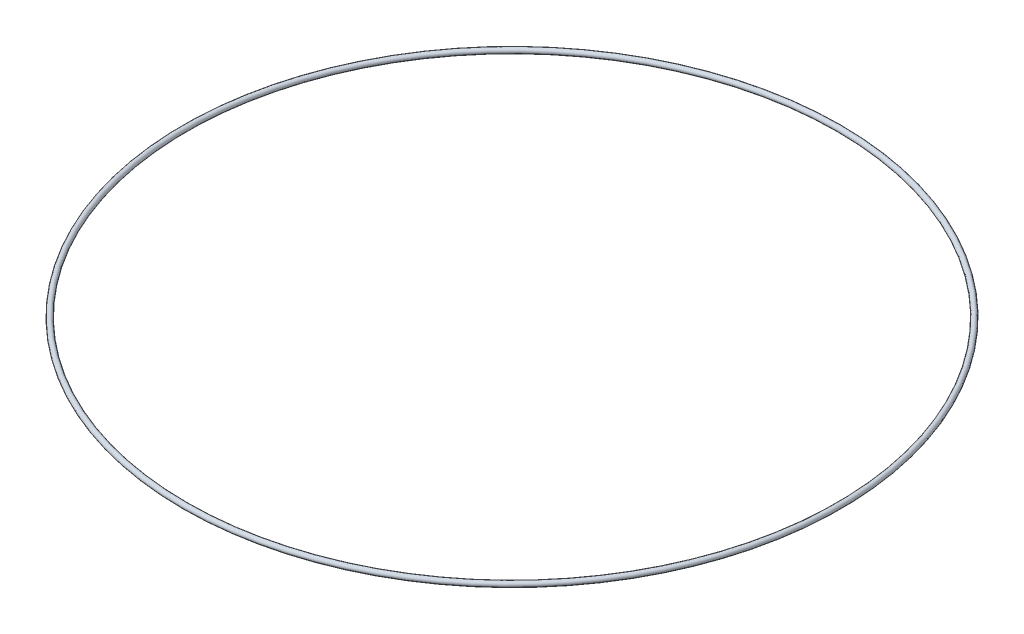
from build123d import *

# Parameters (mm, degrees)
SKETCH1_R = 2.38125


with BuildPart() as part:
    # Sketch1 → Revolve1 (revolve)
    with BuildSketch(Plane.XY, mode=Mode.PRIVATE) as revolve1_sk:
        with Locations((-295.275, 0)):
            Circle(SKETCH1_R)
    revolve(revolve1_sk.sketch.rotate(Axis((0, 96.52, 0), (0, -1, 0)), 270), axis=Axis((0, 96.52, 0), (0, -1, 0)))


solid = part.part
